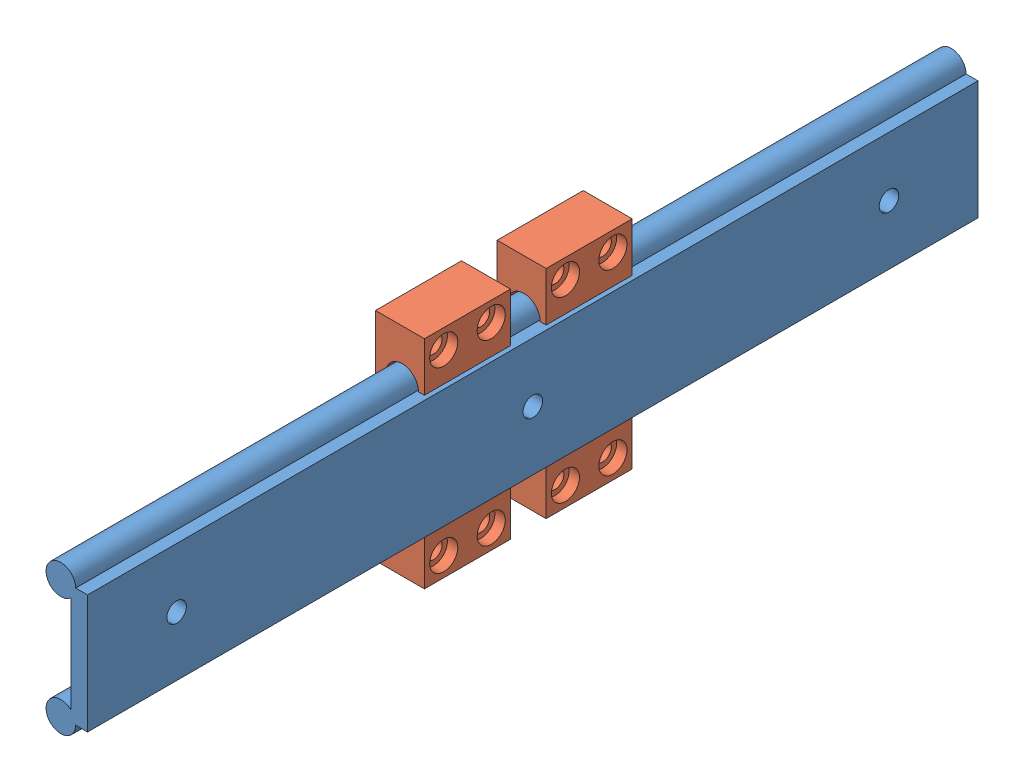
SolidWorks assembly Y-Deslizaderas con patines.SLDASM, configuration Predeterminado (file format 3800). Lengths in mm.
Overall size (18 73 300).
5 component instances, 2 part files, 0 mates.
Components (placement in the parent):
- Y-Deslizadera doble-1: Y-Deslizadera doble.SLDPRT [Predeterminado] at (-22.75 0 0) x (0 -1 0) z (0 0 -1) size (50 14 300)
- Y-Patin-1: Y-Patin.SLDPRT [Predeterminado] at (-29.75 -23.5 -185) x (0 1 0) z (0 0 1) size (26 16.5 29)
- Y-Patin-3: Y-Patin.SLDPRT [Predeterminado] at (-29.75 23.5 -156) x (0 -1 0) z (0 0 -1) size (26 16.5 29)
- Y-Patin-4: Y-Patin.SLDPRT [Predeterminado] at (-29.75 23.5 -115) x (0 -1 0) z (0 0 -1) size (26 16.5 29)
- Y-Patin-6: Y-Patin.SLDPRT [Predeterminado] at (-29.75 -23.5 -144) x (0 1 0) z (0 0 1) size (26 16.5 29)
